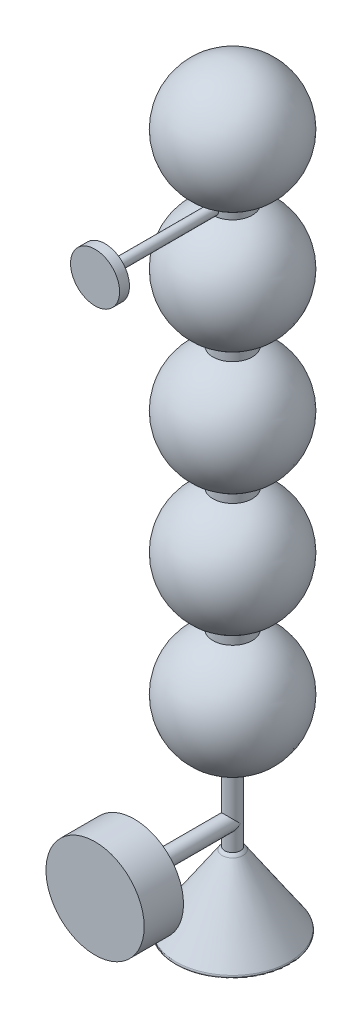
ISO-10303-21;
HEADER;
FILE_DESCRIPTION(('STEP AP214'),'2;1');
FILE_NAME('part.step','',(''),(''),'','','');
FILE_SCHEMA(('AUTOMOTIVE_DESIGN { 1 0 10303 214 1 1 1 1 }'));
ENDSEC;
DATA;
#1=APPLICATION_CONTEXT('core data for automotive mechanical design processes');
#2=APPLICATION_PROTOCOL_DEFINITION('international standard','automotive_design',2000,#1);
#3=PRODUCT_CONTEXT('',#1,'mechanical');
#4=PRODUCT('Part','Part','',(#3));
#5=PRODUCT_RELATED_PRODUCT_CATEGORY('part','',(#4));
#6=PRODUCT_DEFINITION_FORMATION('','',#4);
#7=PRODUCT_DEFINITION_CONTEXT('part definition',#1,'design');
#8=PRODUCT_DEFINITION('design','',#6,#7);
#9=PRODUCT_DEFINITION_SHAPE('','',#8);
#10=(LENGTH_UNIT() NAMED_UNIT(*) SI_UNIT(.MILLI.,.METRE.));
#11=(NAMED_UNIT(*) PLANE_ANGLE_UNIT() SI_UNIT($,.RADIAN.));
#12=(NAMED_UNIT(*) SI_UNIT($,.STERADIAN.) SOLID_ANGLE_UNIT());
#13=UNCERTAINTY_MEASURE_WITH_UNIT(LENGTH_MEASURE(1.E-05),#10,'distance_accuracy_value','');
#14=(GEOMETRIC_REPRESENTATION_CONTEXT(3) GLOBAL_UNCERTAINTY_ASSIGNED_CONTEXT((#13)) GLOBAL_UNIT_ASSIGNED_CONTEXT((#10,
#11,#12)) REPRESENTATION_CONTEXT('',''));
#15=CARTESIAN_POINT('',(0.,0.,0.));
#16=DIRECTION('',(0.,0.,1.));
#17=DIRECTION('',(1.,0.,0.));
#18=AXIS2_PLACEMENT_3D('',#15,#16,#17);
#19=CARTESIAN_POINT('',(0.,0.,0.));
#20=DIRECTION('',(0.,1.,0.));
#21=DIRECTION('',(0.,0.,1.));
#22=AXIS2_PLACEMENT_3D('',#19,#20,#21);
#23=PLANE('',#22);
#24=CARTESIAN_POINT('',(0.,0.,0.));
#25=DIRECTION('',(0.,1.,0.));
#26=DIRECTION('',(0.,0.,1.));
#27=AXIS2_PLACEMENT_3D('',#24,#25,#26);
#28=CIRCLE('',#27,56.2385470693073);
#29=CARTESIAN_POINT('',(0.,0.,56.2385470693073));
#30=VERTEX_POINT('',#29);
#31=EDGE_CURVE('E53',#30,#30,#28,.F.);
#32=ORIENTED_EDGE('',*,*,#31,.T.);
#33=EDGE_LOOP('',(#32));
#34=FACE_BOUND('',#33,.T.);
#35=ADVANCED_FACE('F45',(#34),#23,.F.);
#36=CARTESIAN_POINT('',(0.,73.1618819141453,0.));
#37=DIRECTION('',(0.,-1.,0.));
#38=DIRECTION('',(0.,0.,-1.));
#39=AXIS2_PLACEMENT_3D('',#36,#37,#38);
#40=CONICAL_SURFACE('',#39,10.6516875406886,0.593411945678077);
#41=CARTESIAN_POINT('',(0.,3.1183858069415,0.));
#42=DIRECTION('',(0.,1.,0.));
#43=DIRECTION('',(0.,0.,1.));
#44=AXIS2_PLACEMENT_3D('',#41,#42,#43);
#45=CIRCLE('',#44,57.8966222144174);
#46=CARTESIAN_POINT('',(0.,3.11838580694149,-57.8966222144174));
#47=VERTEX_POINT('',#46);
#48=EDGE_CURVE('E12',#47,#47,#45,.T.);
#49=CARTESIAN_POINT('',(0.,73.1618819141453,0.));
#50=DIRECTION('',(0.,-1.,0.));
#51=DIRECTION('',(0.,0.,-1.));
#52=AXIS2_PLACEMENT_3D('',#49,#50,#51);
#53=CIRCLE('',#52,10.6516875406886);
#54=CARTESIAN_POINT('',(0.,73.1618819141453,-10.6516875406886));
#55=VERTEX_POINT('',#54);
#56=EDGE_CURVE('E77',#55,#55,#53,.T.);
#57=CARTESIAN_POINT('',(0.,3.11838580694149,-57.8966222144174));
#58=CARTESIAN_POINT('',(0.,3.84800555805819,-57.4044874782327));
#59=CARTESIAN_POINT('',(0.,4.5776253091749,-56.912352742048));
#60=CARTESIAN_POINT('',(0.,6.03686481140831,-55.9280832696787));
#61=CARTESIAN_POINT('',(0.,6.76648456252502,-55.435948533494));
#62=CARTESIAN_POINT('',(0.,8.22572406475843,-54.4516790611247));
#63=CARTESIAN_POINT('',(0.,8.95534381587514,-53.95954432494));
#64=CARTESIAN_POINT('',(0.,10.4145833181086,-52.9752748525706));
#65=CARTESIAN_POINT('',(0.,11.1442030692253,-52.483140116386));
#66=CARTESIAN_POINT('',(0.,12.6034425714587,-51.4988706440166));
#67=CARTESIAN_POINT('',(0.,13.3330623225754,-51.0067359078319));
#68=CARTESIAN_POINT('',(0.,14.7923018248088,-50.0224664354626));
#69=CARTESIAN_POINT('',(0.,15.5219215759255,-49.5303316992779));
#70=CARTESIAN_POINT('',(0.,16.9811610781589,-48.5460622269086));
#71=CARTESIAN_POINT('',(0.,17.7107808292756,-48.0539274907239));
#72=CARTESIAN_POINT('',(0.,19.170020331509,-47.0696580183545));
#73=CARTESIAN_POINT('',(0.,19.8996400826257,-46.5775232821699));
#74=CARTESIAN_POINT('',(0.,21.3588795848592,-45.5932538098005));
#75=CARTESIAN_POINT('',(0.,22.0884993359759,-45.1011190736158));
#76=CARTESIAN_POINT('',(0.,23.5477388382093,-44.1168496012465));
#77=CARTESIAN_POINT('',(0.,24.277358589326,-43.6247148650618));
#78=CARTESIAN_POINT('',(0.,25.7365980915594,-42.6404453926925));
#79=CARTESIAN_POINT('',(0.,26.4662178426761,-42.1483106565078));
#80=CARTESIAN_POINT('',(0.,27.9254573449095,-41.1640411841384));
#81=CARTESIAN_POINT('',(0.,28.6550770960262,-40.6719064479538));
#82=CARTESIAN_POINT('',(0.,30.1143165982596,-39.6876369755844));
#83=CARTESIAN_POINT('',(0.,30.8439363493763,-39.1955022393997));
#84=CARTESIAN_POINT('',(0.,32.3031758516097,-38.2112327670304));
#85=CARTESIAN_POINT('',(0.,33.0327956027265,-37.7190980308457));
#86=CARTESIAN_POINT('',(0.,34.4920351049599,-36.7348285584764));
#87=CARTESIAN_POINT('',(0.,35.2216548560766,-36.2426938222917));
#88=CARTESIAN_POINT('',(0.,36.68089435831,-35.2584243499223));
#89=CARTESIAN_POINT('',(0.,37.4105141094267,-34.7662896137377));
#90=CARTESIAN_POINT('',(0.,38.8697536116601,-33.7820201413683));
#91=CARTESIAN_POINT('',(0.,39.5993733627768,-33.2898854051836));
#92=CARTESIAN_POINT('',(0.,41.0586128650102,-32.3056159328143));
#93=CARTESIAN_POINT('',(0.,41.7882326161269,-31.8134811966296));
#94=CARTESIAN_POINT('',(0.,43.2474721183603,-30.8292117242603));
#95=CARTESIAN_POINT('',(0.,43.9770918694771,-30.3370769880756));
#96=CARTESIAN_POINT('',(0.,45.4363313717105,-29.3528075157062));
#97=CARTESIAN_POINT('',(0.,46.1659511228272,-28.8606727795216));
#98=CARTESIAN_POINT('',(0.,47.6251906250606,-27.8764033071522));
#99=CARTESIAN_POINT('',(0.,48.3548103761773,-27.3842685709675));
#100=CARTESIAN_POINT('',(0.,49.8140498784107,-26.3999990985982));
#101=CARTESIAN_POINT('',(0.,50.5436696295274,-25.9078643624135));
#102=CARTESIAN_POINT('',(0.,52.0029091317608,-24.9235948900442));
#103=CARTESIAN_POINT('',(0.,52.7325288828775,-24.4314601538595));
#104=CARTESIAN_POINT('',(0.,54.1917683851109,-23.4471906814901));
#105=CARTESIAN_POINT('',(0.,54.9213881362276,-22.9550559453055));
#106=CARTESIAN_POINT('',(0.,56.3806276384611,-21.9707864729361));
#107=CARTESIAN_POINT('',(0.,57.1102473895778,-21.4786517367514));
#108=CARTESIAN_POINT('',(0.,58.5694868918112,-20.4943822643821));
#109=CARTESIAN_POINT('',(0.,59.2991066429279,-20.0022475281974));
#110=CARTESIAN_POINT('',(0.,60.7583461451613,-19.0179780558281));
#111=CARTESIAN_POINT('',(0.,61.487965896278,-18.5258433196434));
#112=CARTESIAN_POINT('',(0.,62.9472053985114,-17.541573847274));
#113=CARTESIAN_POINT('',(0.,63.6768251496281,-17.0494391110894));
#114=CARTESIAN_POINT('',(0.,65.1360646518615,-16.06516963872));
#115=CARTESIAN_POINT('',(0.,65.8656844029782,-15.5730349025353));
#116=CARTESIAN_POINT('',(0.,67.3249239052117,-14.588765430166));
#117=CARTESIAN_POINT('',(0.,68.0545436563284,-14.0966306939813));
#118=CARTESIAN_POINT('',(0.,69.5137831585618,-13.112361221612));
#119=CARTESIAN_POINT('',(0.,70.2434029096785,-12.6202264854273));
#120=CARTESIAN_POINT('',(0.,71.7026424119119,-11.6359570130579));
#121=CARTESIAN_POINT('',(0.,72.4322621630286,-11.1438222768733));
#122=CARTESIAN_POINT('',(0.,73.1618819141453,-10.6516875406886));
#123=B_SPLINE_CURVE_WITH_KNOTS('',3,(#57,#58,#59,#60,#61,#62,#63,#64,#65,#66,#67,#68,#69,#70,
#71,#72,#73,#74,#75,#76,#77,#78,#79,#80,#81,#82,#83,#84,#85,#86,#87,#88,#89,#90,#91,#92,#93,#94,
#95,#96,#97,#98,#99,#100,#101,#102,#103,#104,#105,#106,#107,#108,#109,#110,#111,#112,#113,#114,
#115,#116,#117,#118,#119,#120,#121,#122),.UNSPECIFIED.,.F.,.F.,(4,2,2,2,2,2,2,2,2,2,2,2,2,2,2,2,
2,2,2,2,2,2,2,2,2,2,2,2,2,2,2,2,4),(0.,2.64024131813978,5.28048263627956,7.92072395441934,
10.5609652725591,13.2012065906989,15.8414479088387,18.4816892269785,21.1219305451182,
23.762171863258,26.4024131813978,29.0426544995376,31.6828958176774,34.3231371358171,
36.9633784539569,39.6036197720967,42.2438610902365,44.8841024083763,47.524343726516,
50.1645850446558,52.8048263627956,55.4450676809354,58.0853089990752,60.7255503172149,
63.3657916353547,66.0060329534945,68.6462742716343,71.286515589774,73.9267569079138,
76.5669982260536,79.2072395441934,81.8474808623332,84.4877221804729),.UNSPECIFIED.);
#124=EDGE_CURVE('BSEAM58',#47,#55,#123,.T.);
#125=ORIENTED_EDGE('',*,*,#48,.T.);
#126=ORIENTED_EDGE('',*,*,#56,.T.);
#127=ORIENTED_EDGE('',*,*,#124,.T.);
#128=ORIENTED_EDGE('',*,*,#124,.F.);
#129=EDGE_LOOP('',(#125,#127,#126,#128));
#130=FACE_BOUND('',#129,.T.);
#131=ADVANCED_FACE('F58',(#130),#40,.T.);
#132=CARTESIAN_POINT('',(0.,64.2147954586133,2.61291362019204));
#133=DIRECTION('',(-1.,0.,0.));
#134=DIRECTION('',(0.,0.,-1.));
#135=AXIS2_PLACEMENT_3D('',#132,#133,#134);
#136=CIRCLE('',#135,16.);
#137=TRIMMED_CURVE('',#136,(PARAMETER_VALUE(-1.40675449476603)),
(PARAMETER_VALUE(1.40675449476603)),.T.,.PARAMETER.);
#138=CARTESIAN_POINT('',(0.,64.2147954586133,0.));
#139=DIRECTION('',(0.,-1.,0.));
#140=AXIS1_PLACEMENT('',#138,#139);
#141=SURFACE_OF_REVOLUTION('',#137,#140);
#142=ORIENTED_EDGE('',*,*,#56,.F.);
#143=EDGE_LOOP('',(#142));
#144=FACE_BOUND('',#143,.T.);
#145=CARTESIAN_POINT('',(0.,80.,0.));
#146=VERTEX_POINT('',#145);
#147=VERTEX_LOOP('',#146);
#148=FACE_BOUND('',#147,.T.);
#149=ADVANCED_FACE('F56',(#144,#148),#141,.T.);
#150=CARTESIAN_POINT('',(0.,2.,0.));
#151=DIRECTION('',(0.,1.,0.));
#152=DIRECTION('',(0.,0.,1.));
#153=AXIS2_PLACEMENT_3D('',#150,#151,#152);
#154=TOROIDAL_SURFACE('',#153,56.2385470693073,2.);
#155=ORIENTED_EDGE('',*,*,#48,.F.);
#156=EDGE_LOOP('',(#155));
#157=FACE_BOUND('',#156,.T.);
#158=ORIENTED_EDGE('',*,*,#31,.F.);
#159=EDGE_LOOP('',(#158));
#160=FACE_BOUND('',#159,.T.);
#161=ADVANCED_FACE('F47',(#157,#160),#154,.T.);
#162=CLOSED_SHELL('',(#35,#131,#149,#161));
#163=MANIFOLD_SOLID_BREP('B2',#162);
#164=CARTESIAN_POINT('',(0.,647.352151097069,140.));
#165=DIRECTION('',(0.,0.,-1.));
#166=DIRECTION('',(-1.,0.,0.));
#167=AXIS2_PLACEMENT_3D('',#164,#165,#166);
#168=CYLINDRICAL_SURFACE('',#167,25.);
#169=CARTESIAN_POINT('',(0.,647.352151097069,140.));
#170=DIRECTION('',(0.,0.,1.));
#171=DIRECTION('',(1.,0.,0.));
#172=AXIS2_PLACEMENT_3D('',#169,#170,#171);
#173=CIRCLE('',#172,25.);
#174=CARTESIAN_POINT('',(25.,647.352151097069,140.));
#175=VERTEX_POINT('',#174);
#176=EDGE_CURVE('E44',#175,#175,#173,.T.);
#177=ORIENTED_EDGE('',*,*,#176,.F.);
#178=EDGE_LOOP('',(#177));
#179=FACE_BOUND('',#178,.T.);
#180=CARTESIAN_POINT('',(0.,647.352151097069,130.));
#181=DIRECTION('',(0.,0.,1.));
#182=DIRECTION('',(1.,0.,0.));
#183=AXIS2_PLACEMENT_3D('',#180,#181,#182);
#184=CIRCLE('',#183,25.);
#185=CARTESIAN_POINT('',(25.,647.352151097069,130.));
#186=VERTEX_POINT('',#185);
#187=EDGE_CURVE('E120',#186,#186,#184,.T.);
#188=ORIENTED_EDGE('',*,*,#187,.T.);
#189=EDGE_LOOP('',(#188));
#190=FACE_BOUND('',#189,.T.);
#191=ADVANCED_FACE('F117',(#179,#190),#168,.T.);
#192=CARTESIAN_POINT('',(0.,647.352151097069,140.));
#193=DIRECTION('',(0.,0.,1.));
#194=DIRECTION('',(1.,0.,0.));
#195=AXIS2_PLACEMENT_3D('',#192,#193,#194);
#196=PLANE('',#195);
#197=ORIENTED_EDGE('',*,*,#176,.T.);
#198=EDGE_LOOP('',(#197));
#199=FACE_BOUND('',#198,.T.);
#200=ADVANCED_FACE('F134',(#199),#196,.T.);
#201=CARTESIAN_POINT('',(0.,647.352151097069,130.));
#202=DIRECTION('',(0.,0.,1.));
#203=DIRECTION('',(1.,0.,0.));
#204=AXIS2_PLACEMENT_3D('',#201,#202,#203);
#205=PLANE('',#204);
#206=ORIENTED_EDGE('',*,*,#187,.F.);
#207=EDGE_LOOP('',(#206));
#208=FACE_BOUND('',#207,.T.);
#209=ADVANCED_FACE('F132',(#208),#205,.F.);
#210=CLOSED_SHELL('',(#191,#200,#209));
#211=MANIFOLD_SOLID_BREP('B6',#210);
#212=CARTESIAN_POINT('',(0.,100.,140.));
#213=DIRECTION('',(0.,0.,-1.));
#214=DIRECTION('',(-1.,0.,0.));
#215=AXIS2_PLACEMENT_3D('',#212,#213,#214);
#216=CYLINDRICAL_SURFACE('',#215,50.);
#217=CARTESIAN_POINT('',(0.,100.,140.));
#218=DIRECTION('',(0.,0.,1.));
#219=DIRECTION('',(1.,0.,0.));
#220=AXIS2_PLACEMENT_3D('',#217,#218,#219);
#221=CIRCLE('',#220,50.);
#222=CARTESIAN_POINT('',(50.,100.,140.));
#223=VERTEX_POINT('',#222);
#224=EDGE_CURVE('E116',#223,#223,#221,.T.);
#225=ORIENTED_EDGE('',*,*,#224,.F.);
#226=EDGE_LOOP('',(#225));
#227=FACE_BOUND('',#226,.T.);
#228=CARTESIAN_POINT('',(0.,100.,100.));
#229=DIRECTION('',(0.,0.,1.));
#230=DIRECTION('',(1.,0.,0.));
#231=AXIS2_PLACEMENT_3D('',#228,#229,#230);
#232=CIRCLE('',#231,50.);
#233=CARTESIAN_POINT('',(50.,100.,100.));
#234=VERTEX_POINT('',#233);
#235=EDGE_CURVE('E171',#234,#234,#232,.T.);
#236=ORIENTED_EDGE('',*,*,#235,.T.);
#237=EDGE_LOOP('',(#236));
#238=FACE_BOUND('',#237,.T.);
#239=ADVANCED_FACE('F168',(#227,#238),#216,.T.);
#240=CARTESIAN_POINT('',(0.,100.,140.));
#241=DIRECTION('',(0.,0.,1.));
#242=DIRECTION('',(1.,0.,0.));
#243=AXIS2_PLACEMENT_3D('',#240,#241,#242);
#244=PLANE('',#243);
#245=ORIENTED_EDGE('',*,*,#224,.T.);
#246=EDGE_LOOP('',(#245));
#247=FACE_BOUND('',#246,.T.);
#248=ADVANCED_FACE('F185',(#247),#244,.T.);
#249=CARTESIAN_POINT('',(0.,100.,100.));
#250=DIRECTION('',(0.,0.,1.));
#251=DIRECTION('',(1.,0.,0.));
#252=AXIS2_PLACEMENT_3D('',#249,#250,#251);
#253=PLANE('',#252);
#254=ORIENTED_EDGE('',*,*,#235,.F.);
#255=EDGE_LOOP('',(#254));
#256=FACE_BOUND('',#255,.T.);
#257=ADVANCED_FACE('F183',(#256),#253,.F.);
#258=CLOSED_SHELL('',(#239,#248,#257));
#259=MANIFOLD_SOLID_BREP('B39',#258);
#260=CARTESIAN_POINT('',(0.,708.149341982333,0.));
#261=DIRECTION('',(0.,-1.,0.));
#262=DIRECTION('',(-1.,0.,0.));
#263=AXIS2_PLACEMENT_3D('',#260,#261,#262);
#264=SPHERICAL_SURFACE('',#263,60.);
#265=CARTESIAN_POINT('',(0.,648.149341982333,0.));
#266=VERTEX_POINT('',#265);
#267=VERTEX_LOOP('',#266);
#268=FACE_BOUND('',#267,.T.);
#269=ADVANCED_FACE('F219',(#268),#264,.T.);
#270=CLOSED_SHELL('',(#269));
#271=MANIFOLD_SOLID_BREP('B111',#270);
#272=CARTESIAN_POINT('',(0.,585.,0.));
#273=DIRECTION('',(0.,1.,0.));
#274=DIRECTION('',(1.,0.,0.));
#275=AXIS2_PLACEMENT_3D('',#272,#273,#274);
#276=SPHERICAL_SURFACE('',#275,60.);
#277=CARTESIAN_POINT('',(0.,645.,0.));
#278=VERTEX_POINT('',#277);
#279=VERTEX_LOOP('',#278);
#280=FACE_BOUND('',#279,.T.);
#281=ADVANCED_FACE('F238',(#280),#276,.T.);
#282=CLOSED_SHELL('',(#281));
#283=MANIFOLD_SOLID_BREP('B164',#282);
#284=CARTESIAN_POINT('',(0.,460.,0.));
#285=DIRECTION('',(0.,1.,0.));
#286=DIRECTION('',(1.,0.,0.));
#287=AXIS2_PLACEMENT_3D('',#284,#285,#286);
#288=SPHERICAL_SURFACE('',#287,60.);
#289=CARTESIAN_POINT('',(0.,520.,0.));
#290=VERTEX_POINT('',#289);
#291=VERTEX_LOOP('',#290);
#292=FACE_BOUND('',#291,.T.);
#293=ADVANCED_FACE('F257',(#292),#288,.T.);
#294=CLOSED_SHELL('',(#293));
#295=MANIFOLD_SOLID_BREP('B215',#294);
#296=CARTESIAN_POINT('',(0.,335.,0.));
#297=DIRECTION('',(0.,1.,0.));
#298=DIRECTION('',(1.,0.,0.));
#299=AXIS2_PLACEMENT_3D('',#296,#297,#298);
#300=SPHERICAL_SURFACE('',#299,60.);
#301=CARTESIAN_POINT('',(0.,395.,0.));
#302=VERTEX_POINT('',#301);
#303=VERTEX_LOOP('',#302);
#304=FACE_BOUND('',#303,.T.);
#305=ADVANCED_FACE('F280',(#304),#300,.T.);
#306=CLOSED_SHELL('',(#305));
#307=MANIFOLD_SOLID_BREP('B234',#306);
#308=CARTESIAN_POINT('',(0.,628.613765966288,0.));
#309=DIRECTION('',(0.,-1.,0.));
#310=DIRECTION('',(0.,0.,-1.));
#311=AXIS2_PLACEMENT_3D('',#308,#309,#310);
#312=CYLINDRICAL_SURFACE('',#311,20.);
#313=CARTESIAN_POINT('',(0.,642.298188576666,0.));
#314=DIRECTION('',(0.,-1.,0.));
#315=DIRECTION('',(0.,0.,-1.));
#316=AXIS2_PLACEMENT_3D('',#313,#314,#315);
#317=CIRCLE('',#316,20.);
#318=CARTESIAN_POINT('',(0.,642.298188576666,-20.));
#319=VERTEX_POINT('',#318);
#320=EDGE_CURVE('E338',#319,#319,#317,.T.);
#321=ORIENTED_EDGE('',*,*,#320,.F.);
#322=EDGE_LOOP('',(#321));
#323=FACE_BOUND('',#322,.T.);
#324=CARTESIAN_POINT('',(-0.732607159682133,652.298188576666,19.9865776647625));
#325=CARTESIAN_POINT('',(-0.870860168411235,652.277727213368,19.9815232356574));
#326=CARTESIAN_POINT('',(-1.00818922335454,652.251446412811,19.9750401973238));
#327=CARTESIAN_POINT('',(-1.28000406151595,652.187544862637,19.9594583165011));
#328=CARTESIAN_POINT('',(-1.41449040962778,652.149926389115,19.9503599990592));
#329=CARTESIAN_POINT('',(-1.6794490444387,652.06371535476,19.9298047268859));
#330=CARTESIAN_POINT('',(-1.80992793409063,652.015142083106,19.9183519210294));
#331=CARTESIAN_POINT('',(-2.06621928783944,651.90737483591,19.8933986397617));
#332=CARTESIAN_POINT('',(-2.19203162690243,651.84818057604,19.8798981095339));
#333=CARTESIAN_POINT('',(-2.43809398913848,651.719638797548,19.8512223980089));
#334=CARTESIAN_POINT('',(-2.55834647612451,651.650295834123,19.8360479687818));
#335=CARTESIAN_POINT('',(-2.79257504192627,651.501943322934,19.8044318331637));
#336=CARTESIAN_POINT('',(-2.90654878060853,651.422930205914,19.7879896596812));
#337=CARTESIAN_POINT('',(-3.23788158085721,651.17218879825,19.7374236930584));
#338=CARTESIAN_POINT('',(-3.44485063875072,650.986654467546,19.7020362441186));
#339=CARTESIAN_POINT('',(-3.82868243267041,650.580281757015,19.6311016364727));
#340=CARTESIAN_POINT('',(-4.00492684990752,650.358860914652,19.5955633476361));
#341=CARTESIAN_POINT('',(-4.31789417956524,649.888964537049,19.5289896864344));
#342=CARTESIAN_POINT('',(-4.45461543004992,649.640487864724,19.4979545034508));
#343=CARTESIAN_POINT('',(-4.68420787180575,649.123606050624,19.4440781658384));
#344=CARTESIAN_POINT('',(-4.77714089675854,648.855229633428,19.4212254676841));
#345=CARTESIAN_POINT('',(-4.91634226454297,648.305977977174,19.3864591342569));
#346=CARTESIAN_POINT('',(-4.96262264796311,648.025105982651,19.374542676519));
#347=CARTESIAN_POINT('',(-5.00627233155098,647.467356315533,19.3633087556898));
#348=CARTESIAN_POINT('',(-5.00498827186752,647.19059042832,19.3636444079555));
#349=CARTESIAN_POINT('',(-4.95688605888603,646.641324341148,19.3760130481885));
#350=CARTESIAN_POINT('',(-4.91006951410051,646.368823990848,19.3880456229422));
#351=CARTESIAN_POINT('',(-4.77321454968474,645.838676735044,19.4221851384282));
#352=CARTESIAN_POINT('',(-4.6836350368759,645.580903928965,19.4441849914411));
#353=CARTESIAN_POINT('',(-4.46419233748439,645.083936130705,19.4957335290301));
#354=CARTESIAN_POINT('',(-4.33432367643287,644.844743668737,19.5252832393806));
#355=CARTESIAN_POINT('',(-4.03436356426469,644.385518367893,19.5894848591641));
#356=CARTESIAN_POINT('',(-3.86338624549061,644.166078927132,19.6242416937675));
#357=CARTESIAN_POINT('',(-3.48753928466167,643.758555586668,19.6945056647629));
#358=CARTESIAN_POINT('',(-3.2826646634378,643.570476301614,19.7300129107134));
#359=CARTESIAN_POINT('',(-2.8395979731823,643.22699758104,19.7986844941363));
#360=CARTESIAN_POINT('',(-2.60079098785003,643.072376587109,19.8317830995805));
#361=CARTESIAN_POINT('',(-2.09975517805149,642.805552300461,19.8910675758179));
#362=CARTESIAN_POINT('',(-1.83752864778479,642.693344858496,19.9172541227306));
#363=CARTESIAN_POINT('',(-1.30063314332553,642.51611901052,19.9594553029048));
#364=CARTESIAN_POINT('',(-1.02617311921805,642.45049950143,19.9755991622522));
#365=CARTESIAN_POINT('',(-0.469719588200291,642.366320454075,19.9964198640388));
#366=CARTESIAN_POINT('',(-0.187727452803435,642.347752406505,20.0010987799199));
#367=CARTESIAN_POINT('',(0.36794837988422,642.358171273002,19.9984958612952));
#368=CARTESIAN_POINT('',(0.641657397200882,642.385933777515,19.9915219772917));
#369=CARTESIAN_POINT('',(1.18036475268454,642.485757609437,19.9669594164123));
#370=CARTESIAN_POINT('',(1.44536304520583,642.557819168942,19.9493706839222));
#371=CARTESIAN_POINT('',(1.95950155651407,642.743988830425,19.9054520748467));
#372=CARTESIAN_POINT('',(2.2086333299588,642.858119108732,19.8791175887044));
#373=CARTESIAN_POINT('',(2.684452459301,643.125075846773,19.820475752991));
#374=CARTESIAN_POINT('',(2.91113624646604,643.277908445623,19.7881674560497));
#375=CARTESIAN_POINT('',(3.34197485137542,643.622634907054,19.7200422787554));
#376=CARTESIAN_POINT('',(3.54538482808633,643.815446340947,19.6841557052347));
#377=CARTESIAN_POINT('',(3.91731486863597,644.232421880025,19.613530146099));
#378=CARTESIAN_POINT('',(4.08583113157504,644.456589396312,19.578791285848));
#379=CARTESIAN_POINT('',(4.38534568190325,644.933658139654,19.5139084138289));
#380=CARTESIAN_POINT('',(4.51580982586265,645.18690476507,19.4838323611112));
#381=CARTESIAN_POINT('',(4.73209323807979,645.71262556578,19.4324404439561));
#382=CARTESIAN_POINT('',(4.81792007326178,645.985096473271,19.4111230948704));
#383=CARTESIAN_POINT('',(4.94072099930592,646.535410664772,19.3802280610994));
#384=CARTESIAN_POINT('',(4.97869100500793,646.813018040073,19.37041136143));
#385=CARTESIAN_POINT('',(5.00775540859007,647.370815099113,19.3629190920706));
#386=CARTESIAN_POINT('',(4.99885760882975,647.651004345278,19.3652415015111));
#387=CARTESIAN_POINT('',(4.93528245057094,648.199117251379,19.3815372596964));
#388=CARTESIAN_POINT('',(4.88167718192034,648.467174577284,19.3952377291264));
#389=CARTESIAN_POINT('',(4.73182956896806,648.990396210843,19.4323360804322));
#390=CARTESIAN_POINT('',(4.63558239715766,649.245559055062,19.4557350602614));
#391=CARTESIAN_POINT('',(4.40203565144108,649.739101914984,19.5099095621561));
#392=CARTESIAN_POINT('',(4.26427205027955,649.977252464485,19.5407676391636));
#393=CARTESIAN_POINT('',(3.9518254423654,650.427553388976,19.6063362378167));
#394=CARTESIAN_POINT('',(3.77713736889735,650.639700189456,19.6410472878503));
#395=CARTESIAN_POINT('',(3.48836037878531,650.937014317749,19.6936872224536));
#396=CARTESIAN_POINT('',(3.38599923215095,651.033844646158,19.7115863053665));
#397=CARTESIAN_POINT('',(3.17343956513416,651.218554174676,19.7469205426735));
#398=CARTESIAN_POINT('',(3.06324385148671,651.306436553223,19.7643558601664));
#399=CARTESIAN_POINT('',(2.83571811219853,651.472656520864,19.7982811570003));
#400=CARTESIAN_POINT('',(2.71838683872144,651.550992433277,19.8147709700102));
#401=CARTESIAN_POINT('',(2.47743012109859,651.697517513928,19.8463370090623));
#402=CARTESIAN_POINT('',(2.3538073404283,651.76571092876,19.8614138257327));
#403=CARTESIAN_POINT('',(2.11038993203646,651.886834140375,19.8886934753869));
#404=CARTESIAN_POINT('',(1.99098456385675,651.940518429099,19.9010262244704));
#405=CARTESIAN_POINT('',(1.74818313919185,652.038406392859,19.9238231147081));
#406=CARTESIAN_POINT('',(1.62478741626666,652.082610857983,19.9342874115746));
#407=CARTESIAN_POINT('',(1.3746334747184,652.161265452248,19.9530974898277));
#408=CARTESIAN_POINT('',(1.2478721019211,652.195706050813,19.9614412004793));
#409=CARTESIAN_POINT('',(0.991881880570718,652.254544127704,19.9758033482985));
#410=CARTESIAN_POINT('',(0.862652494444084,652.278939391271,19.9818212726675));
#411=CARTESIAN_POINT('',(0.732607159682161,652.298188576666,19.9865776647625));
#412=B_SPLINE_CURVE_WITH_KNOTS('',3,(#324,#325,#326,#327,#328,#329,#330,#331,#332,#333,#334,
#335,#336,#337,#338,#339,#340,#341,#342,#343,#344,#345,#346,#347,#348,#349,#350,#351,#352,#353,
#354,#355,#356,#357,#358,#359,#360,#361,#362,#363,#364,#365,#366,#367,#368,#369,#370,#371,#372,
#373,#374,#375,#376,#377,#378,#379,#380,#381,#382,#383,#384,#385,#386,#387,#388,#389,#390,#391,
#392,#393,#394,#395,#396,#397,#398,#399,#400,#401,#402,#403,#404,#405,#406,#407,#408,#409,#410,
#411),.UNSPECIFIED.,.F.,.F.,(4,2,2,2,2,2,2,2,2,2,2,2,2,2,2,2,2,2,2,2,2,2,2,2,2,2,2,2,2,2,2,2,2,
2,2,2,2,2,2,2,2,2,2,4),(0.,0.41940614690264,0.838728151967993,1.25731750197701,1.6759180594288,
2.09433130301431,2.51289945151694,3.34936804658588,4.20110096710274,5.05286969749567,
5.90343200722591,6.75377473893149,7.58006155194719,8.40631917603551,9.22390267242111,
10.0415973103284,10.8788042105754,11.7161341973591,12.5712382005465,13.4262585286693,
14.2700359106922,15.113660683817,15.9353415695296,16.7570267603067,17.5791457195,
18.4013951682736,19.2451631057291,20.0890229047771,20.9442133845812,21.7992588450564,
22.636199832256,23.4730014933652,24.2902948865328,25.1076808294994,25.9345646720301,
26.7615620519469,27.1872579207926,27.6128020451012,28.0384208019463,28.463860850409,
28.8579485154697,29.2520033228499,29.6464414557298,30.0409665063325),.UNSPECIFIED.);
#413=CARTESIAN_POINT('',(-0.732607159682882,652.298188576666,19.9865776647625));
#414=VERTEX_POINT('',#413);
#415=CARTESIAN_POINT('',(0.732607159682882,652.298188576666,19.9865776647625));
#416=VERTEX_POINT('',#415);
#417=EDGE_CURVE('E324',#414,#416,#412,.T.);
#418=ORIENTED_EDGE('',*,*,#417,.F.);
#419=CARTESIAN_POINT('',(0.,652.298188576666,0.));
#420=DIRECTION('',(0.,-1.,0.));
#421=DIRECTION('',(0.,0.,-1.));
#422=AXIS2_PLACEMENT_3D('',#419,#420,#421);
#423=CIRCLE('',#422,20.);
#424=EDGE_CURVE('E330',#414,#416,#423,.T.);
#425=ORIENTED_EDGE('',*,*,#424,.T.);
#426=EDGE_LOOP('',(#418,#425));
#427=FACE_BOUND('',#426,.T.);
#428=ADVANCED_FACE('F301',(#323,#427),#312,.T.);
#429=CARTESIAN_POINT('',(0.,652.298188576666,0.));
#430=DIRECTION('',(0.,-1.,0.));
#431=DIRECTION('',(0.,0.,-1.));
#432=AXIS2_PLACEMENT_3D('',#429,#430,#431);
#433=PLANE('',#432);
#434=DIRECTION('',(0.,0.,-1.));
#435=VECTOR('',#434,1.);
#436=CARTESIAN_POINT('',(-0.732607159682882,652.298188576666,130.));
#437=LINE('',#436,#435);
#438=CARTESIAN_POINT('',(-0.732607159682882,652.298188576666,0.));
#439=VERTEX_POINT('',#438);
#440=EDGE_CURVE('E278',#439,#414,#437,.F.);
#441=ORIENTED_EDGE('',*,*,#440,.F.);
#442=DIRECTION('',(-1.,0.,0.));
#443=VECTOR('',#442,1.);
#444=CARTESIAN_POINT('',(0.,652.298188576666,0.));
#445=LINE('',#444,#443);
#446=CARTESIAN_POINT('',(0.732607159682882,652.298188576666,0.));
#447=VERTEX_POINT('',#446);
#448=EDGE_CURVE('E317',#447,#439,#445,.T.);
#449=ORIENTED_EDGE('',*,*,#448,.F.);
#450=DIRECTION('',(0.,0.,-1.));
#451=VECTOR('',#450,1.);
#452=CARTESIAN_POINT('',(0.732607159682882,652.298188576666,130.));
#453=LINE('',#452,#451);
#454=EDGE_CURVE('E310',#416,#447,#453,.T.);
#455=ORIENTED_EDGE('',*,*,#454,.F.);
#456=ORIENTED_EDGE('',*,*,#424,.F.);
#457=EDGE_LOOP('',(#441,#449,#455,#456));
#458=FACE_BOUND('',#457,.T.);
#459=ADVANCED_FACE('F329',(#458),#433,.F.);
#460=CARTESIAN_POINT('',(0.,642.298188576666,0.));
#461=DIRECTION('',(0.,1.,0.));
#462=DIRECTION('',(0.,0.,1.));
#463=AXIS2_PLACEMENT_3D('',#460,#461,#462);
#464=PLANE('',#463);
#465=ORIENTED_EDGE('',*,*,#320,.T.);
#466=EDGE_LOOP('',(#465));
#467=FACE_BOUND('',#466,.T.);
#468=ADVANCED_FACE('F303',(#467),#464,.F.);
#469=CARTESIAN_POINT('',(0.,647.352151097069,130.));
#470=DIRECTION('',(0.,0.,-1.));
#471=DIRECTION('',(-1.,0.,0.));
#472=AXIS2_PLACEMENT_3D('',#469,#470,#471);
#473=CYLINDRICAL_SURFACE('',#472,5.);
#474=CARTESIAN_POINT('',(0.,647.352151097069,130.));
#475=DIRECTION('',(0.,0.,1.));
#476=DIRECTION('',(1.,0.,0.));
#477=AXIS2_PLACEMENT_3D('',#474,#475,#476);
#478=CIRCLE('',#477,5.);
#479=CARTESIAN_POINT('',(5.,647.352151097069,130.));
#480=VERTEX_POINT('',#479);
#481=EDGE_CURVE('E342',#480,#480,#478,.T.);
#482=ORIENTED_EDGE('',*,*,#481,.F.);
#483=EDGE_LOOP('',(#482));
#484=FACE_BOUND('',#483,.T.);
#485=CARTESIAN_POINT('',(0.,647.352151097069,0.));
#486=DIRECTION('',(0.,0.,1.));
#487=DIRECTION('',(1.,0.,0.));
#488=AXIS2_PLACEMENT_3D('',#485,#486,#487);
#489=CIRCLE('',#488,5.);
#490=EDGE_CURVE('E336',#447,#439,#489,.T.);
#491=ORIENTED_EDGE('',*,*,#490,.T.);
#492=ORIENTED_EDGE('',*,*,#440,.T.);
#493=ORIENTED_EDGE('',*,*,#417,.T.);
#494=ORIENTED_EDGE('',*,*,#454,.T.);
#495=EDGE_LOOP('',(#491,#492,#493,#494));
#496=FACE_BOUND('',#495,.T.);
#497=ADVANCED_FACE('F340',(#484,#496),#473,.T.);
#498=CARTESIAN_POINT('',(0.,647.352151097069,0.));
#499=DIRECTION('',(0.,0.,1.));
#500=DIRECTION('',(1.,0.,0.));
#501=AXIS2_PLACEMENT_3D('',#498,#499,#500);
#502=PLANE('',#501);
#503=ORIENTED_EDGE('',*,*,#490,.F.);
#504=ORIENTED_EDGE('',*,*,#448,.T.);
#505=EDGE_LOOP('',(#503,#504));
#506=FACE_BOUND('',#505,.T.);
#507=ADVANCED_FACE('F335',(#506),#502,.F.);
#508=CARTESIAN_POINT('',(0.,647.352151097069,130.));
#509=DIRECTION('',(0.,0.,1.));
#510=DIRECTION('',(1.,0.,0.));
#511=AXIS2_PLACEMENT_3D('',#508,#509,#510);
#512=PLANE('',#511);
#513=ORIENTED_EDGE('',*,*,#481,.T.);
#514=EDGE_LOOP('',(#513));
#515=FACE_BOUND('',#514,.T.);
#516=ADVANCED_FACE('F397',(#515),#512,.T.);
#517=CLOSED_SHELL('',(#428,#459,#468,#497,#507,#516));
#518=MANIFOLD_SOLID_BREP('B253',#517);
#519=CARTESIAN_POINT('',(0.,517.298188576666,0.));
#520=DIRECTION('',(0.,1.,0.));
#521=DIRECTION('',(0.,0.,1.));
#522=AXIS2_PLACEMENT_3D('',#519,#520,#521);
#523=PLANE('',#522);
#524=CARTESIAN_POINT('',(0.,517.298188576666,0.));
#525=DIRECTION('',(0.,-1.,0.));
#526=DIRECTION('',(0.,0.,-1.));
#527=AXIS2_PLACEMENT_3D('',#524,#525,#526);
#528=CIRCLE('',#527,20.);
#529=CARTESIAN_POINT('',(0.,517.298188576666,-20.));
#530=VERTEX_POINT('',#529);
#531=EDGE_CURVE('E300',#530,#530,#528,.T.);
#532=ORIENTED_EDGE('',*,*,#531,.T.);
#533=EDGE_LOOP('',(#532));
#534=FACE_BOUND('',#533,.T.);
#535=ADVANCED_FACE('F430',(#534),#523,.F.);
#536=CARTESIAN_POINT('',(0.,503.613765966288,0.));
#537=DIRECTION('',(0.,-1.,0.));
#538=DIRECTION('',(0.,0.,-1.));
#539=AXIS2_PLACEMENT_3D('',#536,#537,#538);
#540=CYLINDRICAL_SURFACE('',#539,20.);
#541=ORIENTED_EDGE('',*,*,#531,.F.);
#542=EDGE_LOOP('',(#541));
#543=FACE_BOUND('',#542,.T.);
#544=CARTESIAN_POINT('',(0.,527.298188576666,0.));
#545=DIRECTION('',(0.,-1.,0.));
#546=DIRECTION('',(0.,0.,-1.));
#547=AXIS2_PLACEMENT_3D('',#544,#545,#546);
#548=CIRCLE('',#547,20.);
#549=CARTESIAN_POINT('',(0.,527.298188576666,-20.));
#550=VERTEX_POINT('',#549);
#551=EDGE_CURVE('E437',#550,#550,#548,.T.);
#552=ORIENTED_EDGE('',*,*,#551,.T.);
#553=EDGE_LOOP('',(#552));
#554=FACE_BOUND('',#553,.T.);
#555=ADVANCED_FACE('F444',(#543,#554),#540,.T.);
#556=CARTESIAN_POINT('',(0.,527.298188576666,0.));
#557=DIRECTION('',(0.,-1.,0.));
#558=DIRECTION('',(0.,0.,-1.));
#559=AXIS2_PLACEMENT_3D('',#556,#557,#558);
#560=PLANE('',#559);
#561=ORIENTED_EDGE('',*,*,#551,.F.);
#562=EDGE_LOOP('',(#561));
#563=FACE_BOUND('',#562,.T.);
#564=ADVANCED_FACE('F446',(#563),#560,.F.);
#565=CLOSED_SHELL('',(#535,#555,#564));
#566=MANIFOLD_SOLID_BREP('B272',#565);
#567=CARTESIAN_POINT('',(0.,392.298188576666,0.));
#568=DIRECTION('',(0.,1.,0.));
#569=DIRECTION('',(0.,0.,1.));
#570=AXIS2_PLACEMENT_3D('',#567,#568,#569);
#571=PLANE('',#570);
#572=CARTESIAN_POINT('',(0.,392.298188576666,0.));
#573=DIRECTION('',(0.,-1.,0.));
#574=DIRECTION('',(0.,0.,-1.));
#575=AXIS2_PLACEMENT_3D('',#572,#573,#574);
#576=CIRCLE('',#575,20.);
#577=CARTESIAN_POINT('',(0.,392.298188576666,-20.));
#578=VERTEX_POINT('',#577);
#579=EDGE_CURVE('E429',#578,#578,#576,.T.);
#580=ORIENTED_EDGE('',*,*,#579,.T.);
#581=EDGE_LOOP('',(#580));
#582=FACE_BOUND('',#581,.T.);
#583=ADVANCED_FACE('F483',(#582),#571,.F.);
#584=CARTESIAN_POINT('',(0.,378.613765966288,0.));
#585=DIRECTION('',(0.,-1.,0.));
#586=DIRECTION('',(0.,0.,-1.));
#587=AXIS2_PLACEMENT_3D('',#584,#585,#586);
#588=CYLINDRICAL_SURFACE('',#587,20.);
#589=ORIENTED_EDGE('',*,*,#579,.F.);
#590=EDGE_LOOP('',(#589));
#591=FACE_BOUND('',#590,.T.);
#592=CARTESIAN_POINT('',(0.,402.298188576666,0.));
#593=DIRECTION('',(0.,-1.,0.));
#594=DIRECTION('',(0.,0.,-1.));
#595=AXIS2_PLACEMENT_3D('',#592,#593,#594);
#596=CIRCLE('',#595,20.);
#597=CARTESIAN_POINT('',(0.,402.298188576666,-20.));
#598=VERTEX_POINT('',#597);
#599=EDGE_CURVE('E490',#598,#598,#596,.T.);
#600=ORIENTED_EDGE('',*,*,#599,.T.);
#601=EDGE_LOOP('',(#600));
#602=FACE_BOUND('',#601,.T.);
#603=ADVANCED_FACE('F497',(#591,#602),#588,.T.);
#604=CARTESIAN_POINT('',(0.,402.298188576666,0.));
#605=DIRECTION('',(0.,-1.,0.));
#606=DIRECTION('',(0.,0.,-1.));
#607=AXIS2_PLACEMENT_3D('',#604,#605,#606);
#608=PLANE('',#607);
#609=ORIENTED_EDGE('',*,*,#599,.F.);
#610=EDGE_LOOP('',(#609));
#611=FACE_BOUND('',#610,.T.);
#612=ADVANCED_FACE('F499',(#611),#608,.F.);
#613=CLOSED_SHELL('',(#583,#603,#612));
#614=MANIFOLD_SOLID_BREP('B295',#613);
#615=CARTESIAN_POINT('',(0.,267.298188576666,0.));
#616=DIRECTION('',(0.,1.,0.));
#617=DIRECTION('',(0.,0.,1.));
#618=AXIS2_PLACEMENT_3D('',#615,#616,#617);
#619=PLANE('',#618);
#620=CARTESIAN_POINT('',(0.,267.298188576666,0.));
#621=DIRECTION('',(0.,-1.,0.));
#622=DIRECTION('',(0.,0.,-1.));
#623=AXIS2_PLACEMENT_3D('',#620,#621,#622);
#624=CIRCLE('',#623,20.);
#625=CARTESIAN_POINT('',(0.,267.298188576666,-20.));
#626=VERTEX_POINT('',#625);
#627=EDGE_CURVE('E482',#626,#626,#624,.T.);
#628=ORIENTED_EDGE('',*,*,#627,.T.);
#629=EDGE_LOOP('',(#628));
#630=FACE_BOUND('',#629,.T.);
#631=ADVANCED_FACE('F534',(#630),#619,.F.);
#632=CARTESIAN_POINT('',(0.,253.613765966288,0.));
#633=DIRECTION('',(0.,-1.,0.));
#634=DIRECTION('',(0.,0.,-1.));
#635=AXIS2_PLACEMENT_3D('',#632,#633,#634);
#636=CYLINDRICAL_SURFACE('',#635,20.);
#637=ORIENTED_EDGE('',*,*,#627,.F.);
#638=EDGE_LOOP('',(#637));
#639=FACE_BOUND('',#638,.T.);
#640=CARTESIAN_POINT('',(0.,277.298188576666,0.));
#641=DIRECTION('',(0.,-1.,0.));
#642=DIRECTION('',(0.,0.,-1.));
#643=AXIS2_PLACEMENT_3D('',#640,#641,#642);
#644=CIRCLE('',#643,20.);
#645=CARTESIAN_POINT('',(0.,277.298188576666,-20.));
#646=VERTEX_POINT('',#645);
#647=EDGE_CURVE('E541',#646,#646,#644,.T.);
#648=ORIENTED_EDGE('',*,*,#647,.T.);
#649=EDGE_LOOP('',(#648));
#650=FACE_BOUND('',#649,.T.);
#651=ADVANCED_FACE('F548',(#639,#650),#636,.T.);
#652=CARTESIAN_POINT('',(0.,277.298188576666,0.));
#653=DIRECTION('',(0.,-1.,0.));
#654=DIRECTION('',(0.,0.,-1.));
#655=AXIS2_PLACEMENT_3D('',#652,#653,#654);
#656=PLANE('',#655);
#657=ORIENTED_EDGE('',*,*,#647,.F.);
#658=EDGE_LOOP('',(#657));
#659=FACE_BOUND('',#658,.T.);
#660=ADVANCED_FACE('F550',(#659),#656,.F.);
#661=CLOSED_SHELL('',(#631,#651,#660));
#662=MANIFOLD_SOLID_BREP('B424',#661);
#663=CARTESIAN_POINT('',(0.,210.,0.));
#664=DIRECTION('',(0.,1.,0.));
#665=DIRECTION('',(1.,0.,0.));
#666=AXIS2_PLACEMENT_3D('',#663,#664,#665);
#667=SPHERICAL_SURFACE('',#666,60.);
#668=CARTESIAN_POINT('',(0.,270.,0.));
#669=VERTEX_POINT('',#668);
#670=VERTEX_LOOP('',#669);
#671=FACE_BOUND('',#670,.T.);
#672=ADVANCED_FACE('F588',(#671),#667,.T.);
#673=CLOSED_SHELL('',(#672));
#674=MANIFOLD_SOLID_BREP('B477',#673);
#675=CARTESIAN_POINT('',(0.,150.,0.));
#676=DIRECTION('',(0.,-1.,0.));
#677=DIRECTION('',(0.,0.,-1.));
#678=AXIS2_PLACEMENT_3D('',#675,#676,#677);
#679=CYLINDRICAL_SURFACE('',#678,8.);
#680=CARTESIAN_POINT('',(0.,0.,0.));
#681=DIRECTION('',(0.,1.,0.));
#682=DIRECTION('',(0.,0.,1.));
#683=AXIS2_PLACEMENT_3D('',#680,#681,#682);
#684=CIRCLE('',#683,8.);
#685=CARTESIAN_POINT('',(0.,0.,8.));
#686=VERTEX_POINT('',#685);
#687=EDGE_CURVE('E622',#686,#686,#684,.T.);
#688=ORIENTED_EDGE('',*,*,#687,.T.);
#689=EDGE_LOOP('',(#688));
#690=FACE_BOUND('',#689,.T.);
#691=CARTESIAN_POINT('',(0.,150.,0.));
#692=DIRECTION('',(0.,1.,0.));
#693=DIRECTION('',(0.,0.,1.));
#694=AXIS2_PLACEMENT_3D('',#691,#692,#693);
#695=CIRCLE('',#694,8.);
#696=CARTESIAN_POINT('',(0.,150.,8.));
#697=VERTEX_POINT('',#696);
#698=EDGE_CURVE('E618',#697,#697,#695,.T.);
#699=ORIENTED_EDGE('',*,*,#698,.F.);
#700=EDGE_LOOP('',(#699));
#701=FACE_BOUND('',#700,.T.);
#702=CARTESIAN_POINT('',(0.,100.,0.));
#703=DIRECTION('',(0.,-0.707106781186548,-0.707106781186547));
#704=DIRECTION('',(0.,-0.707106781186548,0.707106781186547));
#705=AXIS2_PLACEMENT_3D('',#702,#703,#704);
#706=ELLIPSE('',#705,11.3137084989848,8.);
#707=CARTESIAN_POINT('',(-8.,100.,0.));
#708=VERTEX_POINT('',#707);
#709=CARTESIAN_POINT('',(8.,100.,0.));
#710=VERTEX_POINT('',#709);
#711=EDGE_CURVE('E586',#708,#710,#706,.F.);
#712=ORIENTED_EDGE('',*,*,#711,.F.);
#713=CARTESIAN_POINT('',(0.,100.,0.));
#714=DIRECTION('',(0.,-0.707106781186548,0.707106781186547));
#715=DIRECTION('',(0.,-0.707106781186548,-0.707106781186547));
#716=AXIS2_PLACEMENT_3D('',#713,#714,#715);
#717=ELLIPSE('',#716,11.3137084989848,8.);
#718=EDGE_CURVE('E609',#710,#708,#717,.T.);
#719=ORIENTED_EDGE('',*,*,#718,.F.);
#720=EDGE_LOOP('',(#712,#719));
#721=FACE_BOUND('',#720,.T.);
#722=ADVANCED_FACE('F601',(#690,#701,#721),#679,.T.);
#723=CARTESIAN_POINT('',(0.,150.,0.));
#724=DIRECTION('',(0.,1.,0.));
#725=DIRECTION('',(0.,0.,1.));
#726=AXIS2_PLACEMENT_3D('',#723,#724,#725);
#727=PLANE('',#726);
#728=ORIENTED_EDGE('',*,*,#698,.T.);
#729=EDGE_LOOP('',(#728));
#730=FACE_BOUND('',#729,.T.);
#731=ADVANCED_FACE('F642',(#730),#727,.T.);
#732=CARTESIAN_POINT('',(0.,0.,0.));
#733=DIRECTION('',(0.,1.,0.));
#734=DIRECTION('',(0.,0.,1.));
#735=AXIS2_PLACEMENT_3D('',#732,#733,#734);
#736=PLANE('',#735);
#737=ORIENTED_EDGE('',*,*,#687,.F.);
#738=EDGE_LOOP('',(#737));
#739=FACE_BOUND('',#738,.T.);
#740=ADVANCED_FACE('F635',(#739),#736,.F.);
#741=CARTESIAN_POINT('',(0.,100.,100.));
#742=DIRECTION('',(0.,0.,-1.));
#743=DIRECTION('',(-1.,0.,0.));
#744=AXIS2_PLACEMENT_3D('',#741,#742,#743);
#745=CYLINDRICAL_SURFACE('',#744,8.);
#746=CARTESIAN_POINT('',(0.,100.,100.));
#747=DIRECTION('',(0.,0.,1.));
#748=DIRECTION('',(1.,0.,0.));
#749=AXIS2_PLACEMENT_3D('',#746,#747,#748);
#750=CIRCLE('',#749,8.);
#751=CARTESIAN_POINT('',(8.,100.,100.));
#752=VERTEX_POINT('',#751);
#753=EDGE_CURVE('E626',#752,#752,#750,.T.);
#754=ORIENTED_EDGE('',*,*,#753,.F.);
#755=EDGE_LOOP('',(#754));
#756=FACE_BOUND('',#755,.T.);
#757=ORIENTED_EDGE('',*,*,#718,.T.);
#758=ORIENTED_EDGE('',*,*,#711,.T.);
#759=EDGE_LOOP('',(#757,#758));
#760=FACE_BOUND('',#759,.T.);
#761=ADVANCED_FACE('F616',(#756,#760),#745,.T.);
#762=CARTESIAN_POINT('',(0.,100.,100.));
#763=DIRECTION('',(0.,0.,1.));
#764=DIRECTION('',(1.,0.,0.));
#765=AXIS2_PLACEMENT_3D('',#762,#763,#764);
#766=PLANE('',#765);
#767=ORIENTED_EDGE('',*,*,#753,.T.);
#768=EDGE_LOOP('',(#767));
#769=FACE_BOUND('',#768,.T.);
#770=ADVANCED_FACE('F632',(#769),#766,.T.);
#771=CLOSED_SHELL('',(#722,#731,#740,#761,#770));
#772=MANIFOLD_SOLID_BREP('B530',#771);
#773=ADVANCED_BREP_SHAPE_REPRESENTATION('',(#18,#163,#211,#259,#271,#283,#295,#307,#518,#566,
#614,#662,#674,#772),#14);
#774=SHAPE_DEFINITION_REPRESENTATION(#9,#773);
ENDSEC;
END-ISO-10303-21;
